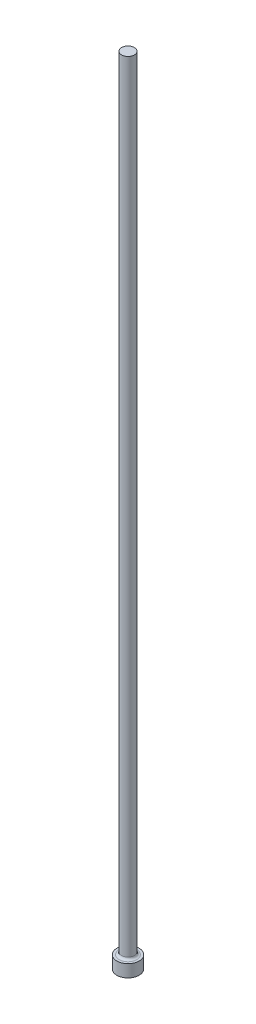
from build123d import *


with BuildPart() as part:
    # Sketch1 → Revolve1 (revolve)
    with BuildSketch(Plane.XY, mode=Mode.PRIVATE) as revolve1_sk:
        with BuildLine():
            Line((0, 0), (3.556, 0))
            Line((3.556, 0), (3.556, 3.9624))
            Line((3.556, 3.9624), (2.80924, 3.9624))
            ThreePointArc((2.80924, 3.9624), (2.270424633, 4.185584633), (2.04724, 4.7244))
            Line((2.04724, 4.7244), (2.04724, 254))
            Line((2.04724, 254), (0, 254))
            Line((0, 254), (0, 0))
        make_face()
    revolve(revolve1_sk.sketch.rotate(Axis((0, 254, 0), (0, -1, 0)), 180), axis=Axis((0, 254, 0), (0, -1, 0)))


solid = part.part
